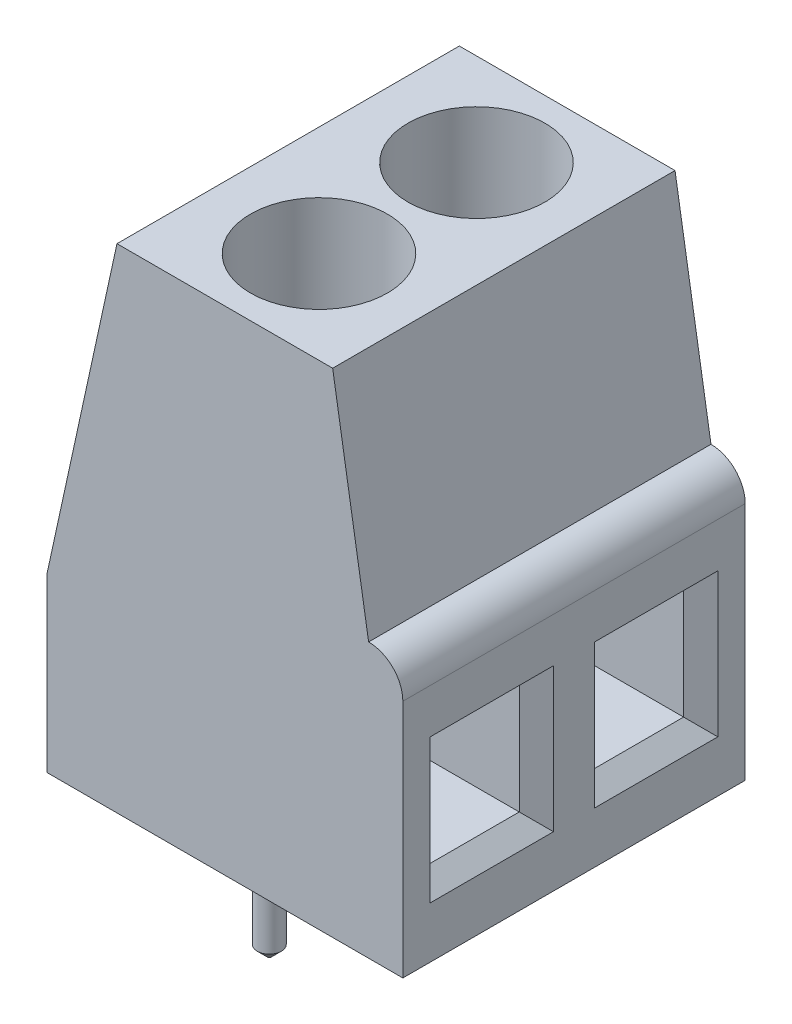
ISO-10303-21;
HEADER;
FILE_DESCRIPTION(('STEP AP214'),'2;1');
FILE_NAME('part.step','',(''),(''),'','','');
FILE_SCHEMA(('AUTOMOTIVE_DESIGN { 1 0 10303 214 1 1 1 1 }'));
ENDSEC;
DATA;
#1=APPLICATION_CONTEXT('core data for automotive mechanical design processes');
#2=APPLICATION_PROTOCOL_DEFINITION('international standard','automotive_design',2000,#1);
#3=PRODUCT_CONTEXT('',#1,'mechanical');
#4=PRODUCT('Part','Part','',(#3));
#5=PRODUCT_RELATED_PRODUCT_CATEGORY('part','',(#4));
#6=PRODUCT_DEFINITION_FORMATION('','',#4);
#7=PRODUCT_DEFINITION_CONTEXT('part definition',#1,'design');
#8=PRODUCT_DEFINITION('design','',#6,#7);
#9=PRODUCT_DEFINITION_SHAPE('','',#8);
#10=(LENGTH_UNIT() NAMED_UNIT(*) SI_UNIT(.MILLI.,.METRE.));
#11=(NAMED_UNIT(*) PLANE_ANGLE_UNIT() SI_UNIT($,.RADIAN.));
#12=(NAMED_UNIT(*) SI_UNIT($,.STERADIAN.) SOLID_ANGLE_UNIT());
#13=UNCERTAINTY_MEASURE_WITH_UNIT(LENGTH_MEASURE(1.E-05),#10,'distance_accuracy_value','');
#14=(GEOMETRIC_REPRESENTATION_CONTEXT(3) GLOBAL_UNCERTAINTY_ASSIGNED_CONTEXT((#13)) GLOBAL_UNIT_ASSIGNED_CONTEXT((#10,
#11,#12)) REPRESENTATION_CONTEXT('',''));
#15=CARTESIAN_POINT('',(0.,0.,0.));
#16=DIRECTION('',(0.,0.,1.));
#17=DIRECTION('',(1.,0.,0.));
#18=AXIS2_PLACEMENT_3D('',#15,#16,#17);
#19=CARTESIAN_POINT('',(0.,0.,-10.));
#20=DIRECTION('',(-1.,0.,0.));
#21=DIRECTION('',(0.,0.,1.));
#22=AXIS2_PLACEMENT_3D('',#19,#20,#21);
#23=PLANE('',#22);
#24=DIRECTION('',(0.,-1.,0.));
#25=VECTOR('',#24,1.);
#26=CARTESIAN_POINT('',(0.,0.,0.));
#27=LINE('',#26,#25);
#28=CARTESIAN_POINT('',(0.,5.,0.));
#29=VERTEX_POINT('',#28);
#30=CARTESIAN_POINT('',(0.,0.,0.));
#31=VERTEX_POINT('',#30);
#32=EDGE_CURVE('E218',#29,#31,#27,.T.);
#33=ORIENTED_EDGE('',*,*,#32,.F.);
#34=DIRECTION('',(0.,0.,1.));
#35=VECTOR('',#34,1.);
#36=CARTESIAN_POINT('',(0.,5.,-10.));
#37=LINE('',#36,#35);
#38=CARTESIAN_POINT('',(0.,5.,-10.));
#39=VERTEX_POINT('',#38);
#40=EDGE_CURVE('E268',#39,#29,#37,.T.);
#41=ORIENTED_EDGE('',*,*,#40,.F.);
#42=DIRECTION('',(0.,-1.,0.));
#43=VECTOR('',#42,1.);
#44=CARTESIAN_POINT('',(0.,0.,-10.));
#45=LINE('',#44,#43);
#46=CARTESIAN_POINT('',(0.,0.,-10.));
#47=VERTEX_POINT('',#46);
#48=EDGE_CURVE('E227',#39,#47,#45,.T.);
#49=ORIENTED_EDGE('',*,*,#48,.T.);
#50=DIRECTION('',(0.,0.,1.));
#51=VECTOR('',#50,1.);
#52=CARTESIAN_POINT('',(0.,0.,-10.));
#53=LINE('',#52,#51);
#54=EDGE_CURVE('E248',#47,#31,#53,.T.);
#55=ORIENTED_EDGE('',*,*,#54,.T.);
#56=EDGE_LOOP('',(#33,#41,#49,#55));
#57=FACE_BOUND('',#56,.T.);
#58=ADVANCED_FACE('F34',(#57),#23,.T.);
#59=CARTESIAN_POINT('',(2.05,14.4,-10.));
#60=DIRECTION('',(-0.977035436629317,0.213076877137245,0.));
#61=DIRECTION('',(-0.213076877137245,-0.977035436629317,0.));
#62=AXIS2_PLACEMENT_3D('',#59,#60,#61);
#63=PLANE('',#62);
#64=DIRECTION('',(-0.213076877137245,-0.977035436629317,0.));
#65=VECTOR('',#64,1.);
#66=CARTESIAN_POINT('',(2.05,14.4,0.));
#67=LINE('',#66,#65);
#68=CARTESIAN_POINT('',(2.05,14.4,0.));
#69=VERTEX_POINT('',#68);
#70=EDGE_CURVE('E231',#69,#29,#67,.T.);
#71=ORIENTED_EDGE('',*,*,#70,.F.);
#72=DIRECTION('',(0.,0.,1.));
#73=VECTOR('',#72,1.);
#74=CARTESIAN_POINT('',(2.05,14.4,-10.));
#75=LINE('',#74,#73);
#76=CARTESIAN_POINT('',(2.05,14.4,-10.));
#77=VERTEX_POINT('',#76);
#78=EDGE_CURVE('E271',#77,#69,#75,.T.);
#79=ORIENTED_EDGE('',*,*,#78,.F.);
#80=DIRECTION('',(-0.213076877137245,-0.977035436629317,0.));
#81=VECTOR('',#80,1.);
#82=CARTESIAN_POINT('',(2.05,14.4,-10.));
#83=LINE('',#82,#81);
#84=EDGE_CURVE('E245',#77,#39,#83,.T.);
#85=ORIENTED_EDGE('',*,*,#84,.T.);
#86=ORIENTED_EDGE('',*,*,#40,.T.);
#87=EDGE_LOOP('',(#71,#79,#85,#86));
#88=FACE_BOUND('',#87,.T.);
#89=ADVANCED_FACE('F353',(#88),#63,.T.);
#90=CARTESIAN_POINT('',(5.2,14.4,-10.));
#91=DIRECTION('',(0.,1.,0.));
#92=DIRECTION('',(0.,0.,1.));
#93=AXIS2_PLACEMENT_3D('',#90,#91,#92);
#94=PLANE('',#93);
#95=CARTESIAN_POINT('',(5.25,14.4,-7.3));
#96=DIRECTION('',(0.,1.,0.));
#97=DIRECTION('',(0.,0.,1.));
#98=AXIS2_PLACEMENT_3D('',#95,#96,#97);
#99=CIRCLE('',#98,2.);
#100=CARTESIAN_POINT('',(5.25,14.4,-5.3));
#101=VERTEX_POINT('',#100);
#102=EDGE_CURVE('E498',#101,#101,#99,.T.);
#103=ORIENTED_EDGE('',*,*,#102,.F.);
#104=EDGE_LOOP('',(#103));
#105=FACE_BOUND('',#104,.T.);
#106=CARTESIAN_POINT('',(5.25,14.4,-2.7));
#107=DIRECTION('',(0.,1.,0.));
#108=DIRECTION('',(0.,0.,1.));
#109=AXIS2_PLACEMENT_3D('',#106,#107,#108);
#110=CIRCLE('',#109,2.);
#111=CARTESIAN_POINT('',(5.25,14.4,-0.7));
#112=VERTEX_POINT('',#111);
#113=EDGE_CURVE('E192',#112,#112,#110,.T.);
#114=ORIENTED_EDGE('',*,*,#113,.F.);
#115=EDGE_LOOP('',(#114));
#116=FACE_BOUND('',#115,.T.);
#117=DIRECTION('',(-1.,0.,0.));
#118=VECTOR('',#117,1.);
#119=CARTESIAN_POINT('',(5.2,14.4,0.));
#120=LINE('',#119,#118);
#121=CARTESIAN_POINT('',(8.35,14.4,0.));
#122=VERTEX_POINT('',#121);
#123=EDGE_CURVE('E263',#122,#69,#120,.T.);
#124=ORIENTED_EDGE('',*,*,#123,.F.);
#125=DIRECTION('',(0.,0.,1.));
#126=VECTOR('',#125,1.);
#127=CARTESIAN_POINT('',(8.35,14.4,-10.));
#128=LINE('',#127,#126);
#129=CARTESIAN_POINT('',(8.35,14.4,-10.));
#130=VERTEX_POINT('',#129);
#131=EDGE_CURVE('E273',#130,#122,#128,.T.);
#132=ORIENTED_EDGE('',*,*,#131,.F.);
#133=DIRECTION('',(-1.,0.,0.));
#134=VECTOR('',#133,1.);
#135=CARTESIAN_POINT('',(5.2,14.4,-10.));
#136=LINE('',#135,#134);
#137=EDGE_CURVE('E243',#130,#77,#136,.T.);
#138=ORIENTED_EDGE('',*,*,#137,.T.);
#139=ORIENTED_EDGE('',*,*,#78,.T.);
#140=EDGE_LOOP('',(#124,#132,#138,#139));
#141=FACE_BOUND('',#140,.T.);
#142=ADVANCED_FACE('F359',(#105,#116,#141),#94,.T.);
#143=CARTESIAN_POINT('',(8.35,14.4,-10.));
#144=DIRECTION('',(0.986807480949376,0.161898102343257,0.));
#145=DIRECTION('',(-0.161898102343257,0.986807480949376,0.));
#146=AXIS2_PLACEMENT_3D('',#143,#144,#145);
#147=PLANE('',#146);
#148=DIRECTION('',(-0.161898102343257,0.986807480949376,0.));
#149=VECTOR('',#148,1.);
#150=CARTESIAN_POINT('',(8.35,14.4,0.));
#151=LINE('',#150,#149);
#152=CARTESIAN_POINT('',(9.4,8.,0.));
#153=VERTEX_POINT('',#152);
#154=EDGE_CURVE('E260',#153,#122,#151,.T.);
#155=ORIENTED_EDGE('',*,*,#154,.F.);
#156=DIRECTION('',(0.,0.,1.));
#157=VECTOR('',#156,1.);
#158=CARTESIAN_POINT('',(9.4,8.,-10.));
#159=LINE('',#158,#157);
#160=CARTESIAN_POINT('',(9.4,8.,-10.));
#161=VERTEX_POINT('',#160);
#162=EDGE_CURVE('E276',#161,#153,#159,.T.);
#163=ORIENTED_EDGE('',*,*,#162,.F.);
#164=DIRECTION('',(-0.161898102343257,0.986807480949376,0.));
#165=VECTOR('',#164,1.);
#166=CARTESIAN_POINT('',(8.35,14.4,-10.));
#167=LINE('',#166,#165);
#168=EDGE_CURVE('E240',#161,#130,#167,.T.);
#169=ORIENTED_EDGE('',*,*,#168,.T.);
#170=ORIENTED_EDGE('',*,*,#131,.T.);
#171=EDGE_LOOP('',(#155,#163,#169,#170));
#172=FACE_BOUND('',#171,.T.);
#173=ADVANCED_FACE('F459',(#172),#147,.T.);
#174=CARTESIAN_POINT('',(9.4,7.,-10.));
#175=DIRECTION('',(0.,0.,1.));
#176=DIRECTION('',(1.,0.,0.));
#177=AXIS2_PLACEMENT_3D('',#174,#175,#176);
#178=CYLINDRICAL_SURFACE('',#177,1.);
#179=CARTESIAN_POINT('',(9.4,7.,0.));
#180=DIRECTION('',(0.,0.,1.));
#181=DIRECTION('',(1.,0.,0.));
#182=AXIS2_PLACEMENT_3D('',#179,#180,#181);
#183=CIRCLE('',#182,1.);
#184=CARTESIAN_POINT('',(10.4,7.,0.));
#185=VERTEX_POINT('',#184);
#186=EDGE_CURVE('E257',#185,#153,#183,.T.);
#187=ORIENTED_EDGE('',*,*,#186,.F.);
#188=DIRECTION('',(0.,0.,1.));
#189=VECTOR('',#188,1.);
#190=CARTESIAN_POINT('',(10.4,7.,-10.));
#191=LINE('',#190,#189);
#192=CARTESIAN_POINT('',(10.4,7.,-10.));
#193=VERTEX_POINT('',#192);
#194=EDGE_CURVE('E278',#193,#185,#191,.T.);
#195=ORIENTED_EDGE('',*,*,#194,.F.);
#196=CARTESIAN_POINT('',(9.4,7.,-10.));
#197=DIRECTION('',(0.,0.,1.));
#198=DIRECTION('',(1.,0.,0.));
#199=AXIS2_PLACEMENT_3D('',#196,#197,#198);
#200=CIRCLE('',#199,1.);
#201=EDGE_CURVE('E237',#193,#161,#200,.T.);
#202=ORIENTED_EDGE('',*,*,#201,.T.);
#203=ORIENTED_EDGE('',*,*,#162,.T.);
#204=EDGE_LOOP('',(#187,#195,#202,#203));
#205=FACE_BOUND('',#204,.T.);
#206=ADVANCED_FACE('F463',(#205),#178,.T.);
#207=CARTESIAN_POINT('',(10.4,0.,-10.));
#208=DIRECTION('',(1.,0.,0.));
#209=DIRECTION('',(0.,0.,-1.));
#210=AXIS2_PLACEMENT_3D('',#207,#208,#209);
#211=PLANE('',#210);
#212=DIRECTION('',(0.,0.,1.));
#213=VECTOR('',#212,1.);
#214=CARTESIAN_POINT('',(10.4,1.5,-6.1));
#215=LINE('',#214,#213);
#216=CARTESIAN_POINT('',(10.4,1.5,-9.2));
#217=VERTEX_POINT('',#216);
#218=CARTESIAN_POINT('',(10.4,1.5,-5.6));
#219=VERTEX_POINT('',#218);
#220=EDGE_CURVE('E314',#217,#219,#215,.T.);
#221=ORIENTED_EDGE('',*,*,#220,.T.);
#222=DIRECTION('',(0.,1.,0.));
#223=VECTOR('',#222,1.);
#224=CARTESIAN_POINT('',(10.4,5.2,-5.6));
#225=LINE('',#224,#223);
#226=CARTESIAN_POINT('',(10.4,5.7,-5.6));
#227=VERTEX_POINT('',#226);
#228=EDGE_CURVE('E316',#219,#227,#225,.T.);
#229=ORIENTED_EDGE('',*,*,#228,.T.);
#230=DIRECTION('',(0.,0.,-1.));
#231=VECTOR('',#230,1.);
#232=CARTESIAN_POINT('',(10.4,5.7,-8.7));
#233=LINE('',#232,#231);
#234=CARTESIAN_POINT('',(10.4,5.7,-9.2));
#235=VERTEX_POINT('',#234);
#236=EDGE_CURVE('E310',#227,#235,#233,.T.);
#237=ORIENTED_EDGE('',*,*,#236,.T.);
#238=DIRECTION('',(0.,-1.,0.));
#239=VECTOR('',#238,1.);
#240=CARTESIAN_POINT('',(10.4,2.,-9.2));
#241=LINE('',#240,#239);
#242=EDGE_CURVE('E312',#235,#217,#241,.T.);
#243=ORIENTED_EDGE('',*,*,#242,.T.);
#244=EDGE_LOOP('',(#221,#229,#237,#243));
#245=FACE_BOUND('',#244,.T.);
#246=DIRECTION('',(0.,-1.,0.));
#247=VECTOR('',#246,1.);
#248=CARTESIAN_POINT('',(10.4,2.,-4.4));
#249=LINE('',#248,#247);
#250=CARTESIAN_POINT('',(10.4,5.7,-4.4));
#251=VERTEX_POINT('',#250);
#252=CARTESIAN_POINT('',(10.4,1.5,-4.4));
#253=VERTEX_POINT('',#252);
#254=EDGE_CURVE('E289',#251,#253,#249,.T.);
#255=ORIENTED_EDGE('',*,*,#254,.T.);
#256=DIRECTION('',(0.,0.,1.));
#257=VECTOR('',#256,1.);
#258=CARTESIAN_POINT('',(10.4,1.5,-1.3));
#259=LINE('',#258,#257);
#260=CARTESIAN_POINT('',(10.4,1.5,-0.799999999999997));
#261=VERTEX_POINT('',#260);
#262=EDGE_CURVE('E291',#253,#261,#259,.T.);
#263=ORIENTED_EDGE('',*,*,#262,.T.);
#264=DIRECTION('',(0.,1.,0.));
#265=VECTOR('',#264,1.);
#266=CARTESIAN_POINT('',(10.4,5.2,-0.799999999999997));
#267=LINE('',#266,#265);
#268=CARTESIAN_POINT('',(10.4,5.7,-0.799999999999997));
#269=VERTEX_POINT('',#268);
#270=EDGE_CURVE('E285',#261,#269,#267,.T.);
#271=ORIENTED_EDGE('',*,*,#270,.T.);
#272=DIRECTION('',(0.,0.,-1.));
#273=VECTOR('',#272,1.);
#274=CARTESIAN_POINT('',(10.4,5.7,-3.9));
#275=LINE('',#274,#273);
#276=EDGE_CURVE('E287',#269,#251,#275,.T.);
#277=ORIENTED_EDGE('',*,*,#276,.T.);
#278=EDGE_LOOP('',(#255,#263,#271,#277));
#279=FACE_BOUND('',#278,.T.);
#280=DIRECTION('',(0.,1.,0.));
#281=VECTOR('',#280,1.);
#282=CARTESIAN_POINT('',(10.4,0.,0.));
#283=LINE('',#282,#281);
#284=CARTESIAN_POINT('',(10.4,0.,0.));
#285=VERTEX_POINT('',#284);
#286=EDGE_CURVE('E254',#285,#185,#283,.T.);
#287=ORIENTED_EDGE('',*,*,#286,.F.);
#288=DIRECTION('',(0.,0.,1.));
#289=VECTOR('',#288,1.);
#290=CARTESIAN_POINT('',(10.4,0.,-10.));
#291=LINE('',#290,#289);
#292=CARTESIAN_POINT('',(10.4,0.,-10.));
#293=VERTEX_POINT('',#292);
#294=EDGE_CURVE('E280',#293,#285,#291,.T.);
#295=ORIENTED_EDGE('',*,*,#294,.F.);
#296=DIRECTION('',(0.,1.,0.));
#297=VECTOR('',#296,1.);
#298=CARTESIAN_POINT('',(10.4,0.,-10.));
#299=LINE('',#298,#297);
#300=EDGE_CURVE('E234',#293,#193,#299,.T.);
#301=ORIENTED_EDGE('',*,*,#300,.T.);
#302=ORIENTED_EDGE('',*,*,#194,.T.);
#303=EDGE_LOOP('',(#287,#295,#301,#302));
#304=FACE_BOUND('',#303,.T.);
#305=ADVANCED_FACE('F407',(#245,#279,#304),#211,.T.);
#306=CARTESIAN_POINT('',(0.,0.,-10.));
#307=DIRECTION('',(0.,-1.,0.));
#308=DIRECTION('',(0.,0.,-1.));
#309=AXIS2_PLACEMENT_3D('',#306,#307,#308);
#310=PLANE('',#309);
#311=CARTESIAN_POINT('',(4.3,0.,-7.8));
#312=DIRECTION('',(0.,-1.,0.));
#313=DIRECTION('',(0.,0.,-1.));
#314=AXIS2_PLACEMENT_3D('',#311,#312,#313);
#315=CIRCLE('',#314,0.35);
#316=CARTESIAN_POINT('',(4.3,0.,-8.15));
#317=VERTEX_POINT('',#316);
#318=EDGE_CURVE('E477',#317,#317,#315,.T.);
#319=ORIENTED_EDGE('',*,*,#318,.F.);
#320=EDGE_LOOP('',(#319));
#321=FACE_BOUND('',#320,.T.);
#322=CARTESIAN_POINT('',(4.3,0.,-2.2));
#323=DIRECTION('',(0.,-1.,0.));
#324=DIRECTION('',(0.,0.,-1.));
#325=AXIS2_PLACEMENT_3D('',#322,#323,#324);
#326=CIRCLE('',#325,0.35);
#327=CARTESIAN_POINT('',(4.3,0.,-2.55));
#328=VERTEX_POINT('',#327);
#329=EDGE_CURVE('E481',#328,#328,#326,.T.);
#330=ORIENTED_EDGE('',*,*,#329,.F.);
#331=EDGE_LOOP('',(#330));
#332=FACE_BOUND('',#331,.T.);
#333=DIRECTION('',(1.,0.,0.));
#334=VECTOR('',#333,1.);
#335=CARTESIAN_POINT('',(0.,0.,0.));
#336=LINE('',#335,#334);
#337=EDGE_CURVE('E251',#31,#285,#336,.T.);
#338=ORIENTED_EDGE('',*,*,#337,.F.);
#339=ORIENTED_EDGE('',*,*,#54,.F.);
#340=DIRECTION('',(1.,0.,0.));
#341=VECTOR('',#340,1.);
#342=CARTESIAN_POINT('',(0.,0.,-10.));
#343=LINE('',#342,#341);
#344=EDGE_CURVE('E230',#47,#293,#343,.T.);
#345=ORIENTED_EDGE('',*,*,#344,.T.);
#346=ORIENTED_EDGE('',*,*,#294,.T.);
#347=EDGE_LOOP('',(#338,#339,#345,#346));
#348=FACE_BOUND('',#347,.T.);
#349=ADVANCED_FACE('F365',(#321,#332,#348),#310,.T.);
#350=CARTESIAN_POINT('',(9.4,7.,-10.));
#351=DIRECTION('',(0.,0.,1.));
#352=DIRECTION('',(1.,0.,0.));
#353=AXIS2_PLACEMENT_3D('',#350,#351,#352);
#354=PLANE('',#353);
#355=ORIENTED_EDGE('',*,*,#48,.F.);
#356=ORIENTED_EDGE('',*,*,#84,.F.);
#357=ORIENTED_EDGE('',*,*,#137,.F.);
#358=ORIENTED_EDGE('',*,*,#168,.F.);
#359=ORIENTED_EDGE('',*,*,#201,.F.);
#360=ORIENTED_EDGE('',*,*,#300,.F.);
#361=ORIENTED_EDGE('',*,*,#344,.F.);
#362=EDGE_LOOP('',(#355,#356,#357,#358,#359,#360,#361));
#363=FACE_BOUND('',#362,.T.);
#364=ADVANCED_FACE('F450',(#363),#354,.F.);
#365=CARTESIAN_POINT('',(9.4,7.,0.));
#366=DIRECTION('',(0.,0.,1.));
#367=DIRECTION('',(1.,0.,0.));
#368=AXIS2_PLACEMENT_3D('',#365,#366,#367);
#369=PLANE('',#368);
#370=ORIENTED_EDGE('',*,*,#32,.T.);
#371=ORIENTED_EDGE('',*,*,#337,.T.);
#372=ORIENTED_EDGE('',*,*,#286,.T.);
#373=ORIENTED_EDGE('',*,*,#186,.T.);
#374=ORIENTED_EDGE('',*,*,#154,.T.);
#375=ORIENTED_EDGE('',*,*,#123,.T.);
#376=ORIENTED_EDGE('',*,*,#70,.T.);
#377=EDGE_LOOP('',(#370,#371,#372,#373,#374,#375,#376));
#378=FACE_BOUND('',#377,.T.);
#379=ADVANCED_FACE('F448',(#378),#369,.T.);
#380=CARTESIAN_POINT('',(5.4,2.,-1.3));
#381=DIRECTION('',(0.,0.,1.));
#382=DIRECTION('',(1.,0.,0.));
#383=AXIS2_PLACEMENT_3D('',#380,#381,#382);
#384=PLANE('',#383);
#385=DIRECTION('',(1.,0.,0.));
#386=VECTOR('',#385,1.);
#387=CARTESIAN_POINT('',(5.4,5.2,-1.3));
#388=LINE('',#387,#386);
#389=CARTESIAN_POINT('',(5.4,5.2,-1.3));
#390=VERTEX_POINT('',#389);
#391=CARTESIAN_POINT('',(9.9,5.2,-1.3));
#392=VERTEX_POINT('',#391);
#393=EDGE_CURVE('E215',#390,#392,#388,.T.);
#394=ORIENTED_EDGE('',*,*,#393,.T.);
#395=DIRECTION('',(0.,-1.,0.));
#396=VECTOR('',#395,1.);
#397=CARTESIAN_POINT('',(9.9,2.,-1.3));
#398=LINE('',#397,#396);
#399=CARTESIAN_POINT('',(9.9,2.,-1.3));
#400=VERTEX_POINT('',#399);
#401=EDGE_CURVE('E298',#392,#400,#398,.T.);
#402=ORIENTED_EDGE('',*,*,#401,.T.);
#403=DIRECTION('',(1.,0.,0.));
#404=VECTOR('',#403,1.);
#405=CARTESIAN_POINT('',(5.4,2.,-1.3));
#406=LINE('',#405,#404);
#407=CARTESIAN_POINT('',(5.4,2.,-1.3));
#408=VERTEX_POINT('',#407);
#409=EDGE_CURVE('E214',#408,#400,#406,.T.);
#410=ORIENTED_EDGE('',*,*,#409,.F.);
#411=DIRECTION('',(0.,-1.,0.));
#412=VECTOR('',#411,1.);
#413=CARTESIAN_POINT('',(5.4,2.,-1.3));
#414=LINE('',#413,#412);
#415=EDGE_CURVE('E199',#390,#408,#414,.T.);
#416=ORIENTED_EDGE('',*,*,#415,.F.);
#417=EDGE_LOOP('',(#394,#402,#410,#416));
#418=FACE_BOUND('',#417,.T.);
#419=ADVANCED_FACE('F438',(#418),#384,.F.);
#420=CARTESIAN_POINT('',(5.4,5.2,-1.3));
#421=DIRECTION('',(0.,1.,0.));
#422=DIRECTION('',(0.,0.,1.));
#423=AXIS2_PLACEMENT_3D('',#420,#421,#422);
#424=PLANE('',#423);
#425=DIRECTION('',(1.,0.,0.));
#426=VECTOR('',#425,1.);
#427=CARTESIAN_POINT('',(5.4,5.2,-3.9));
#428=LINE('',#427,#426);
#429=CARTESIAN_POINT('',(5.4,5.2,-3.9));
#430=VERTEX_POINT('',#429);
#431=CARTESIAN_POINT('',(9.9,5.2,-3.9));
#432=VERTEX_POINT('',#431);
#433=EDGE_CURVE('E219',#430,#432,#428,.T.);
#434=ORIENTED_EDGE('',*,*,#433,.T.);
#435=DIRECTION('',(0.,0.,1.));
#436=VECTOR('',#435,1.);
#437=CARTESIAN_POINT('',(9.9,5.2,-1.3));
#438=LINE('',#437,#436);
#439=EDGE_CURVE('E296',#432,#392,#438,.T.);
#440=ORIENTED_EDGE('',*,*,#439,.T.);
#441=ORIENTED_EDGE('',*,*,#393,.F.);
#442=DIRECTION('',(0.,0.,1.));
#443=VECTOR('',#442,1.);
#444=CARTESIAN_POINT('',(5.4,5.2,-1.3));
#445=LINE('',#444,#443);
#446=EDGE_CURVE('E211',#430,#390,#445,.T.);
#447=ORIENTED_EDGE('',*,*,#446,.F.);
#448=EDGE_LOOP('',(#434,#440,#441,#447));
#449=FACE_BOUND('',#448,.T.);
#450=ADVANCED_FACE('F434',(#449),#424,.F.);
#451=CARTESIAN_POINT('',(5.4,2.,-3.9));
#452=DIRECTION('',(0.,0.,-1.));
#453=DIRECTION('',(-1.,0.,0.));
#454=AXIS2_PLACEMENT_3D('',#451,#452,#453);
#455=PLANE('',#454);
#456=DIRECTION('',(1.,0.,0.));
#457=VECTOR('',#456,1.);
#458=CARTESIAN_POINT('',(5.4,2.,-3.9));
#459=LINE('',#458,#457);
#460=CARTESIAN_POINT('',(5.4,2.,-3.9));
#461=VERTEX_POINT('',#460);
#462=CARTESIAN_POINT('',(9.9,2.,-3.9));
#463=VERTEX_POINT('',#462);
#464=EDGE_CURVE('E222',#461,#463,#459,.T.);
#465=ORIENTED_EDGE('',*,*,#464,.T.);
#466=DIRECTION('',(0.,1.,0.));
#467=VECTOR('',#466,1.);
#468=CARTESIAN_POINT('',(9.9,5.2,-3.9));
#469=LINE('',#468,#467);
#470=EDGE_CURVE('E294',#463,#432,#469,.T.);
#471=ORIENTED_EDGE('',*,*,#470,.T.);
#472=ORIENTED_EDGE('',*,*,#433,.F.);
#473=DIRECTION('',(0.,1.,0.));
#474=VECTOR('',#473,1.);
#475=CARTESIAN_POINT('',(5.4,2.,-3.9));
#476=LINE('',#475,#474);
#477=EDGE_CURVE('E208',#461,#430,#476,.T.);
#478=ORIENTED_EDGE('',*,*,#477,.F.);
#479=EDGE_LOOP('',(#465,#471,#472,#478));
#480=FACE_BOUND('',#479,.T.);
#481=ADVANCED_FACE('F437',(#480),#455,.F.);
#482=CARTESIAN_POINT('',(5.4,2.,-1.3));
#483=DIRECTION('',(0.,-1.,0.));
#484=DIRECTION('',(0.,0.,-1.));
#485=AXIS2_PLACEMENT_3D('',#482,#483,#484);
#486=PLANE('',#485);
#487=ORIENTED_EDGE('',*,*,#409,.T.);
#488=DIRECTION('',(0.,0.,-1.));
#489=VECTOR('',#488,1.);
#490=CARTESIAN_POINT('',(9.9,2.,-3.9));
#491=LINE('',#490,#489);
#492=EDGE_CURVE('E270',#400,#463,#491,.T.);
#493=ORIENTED_EDGE('',*,*,#492,.T.);
#494=ORIENTED_EDGE('',*,*,#464,.F.);
#495=DIRECTION('',(0.,0.,-1.));
#496=VECTOR('',#495,1.);
#497=CARTESIAN_POINT('',(5.4,2.,-1.3));
#498=LINE('',#497,#496);
#499=EDGE_CURVE('E205',#408,#461,#498,.T.);
#500=ORIENTED_EDGE('',*,*,#499,.F.);
#501=EDGE_LOOP('',(#487,#493,#494,#500));
#502=FACE_BOUND('',#501,.T.);
#503=ADVANCED_FACE('F432',(#502),#486,.F.);
#504=CARTESIAN_POINT('',(5.4,0.,0.));
#505=DIRECTION('',(-1.,0.,0.));
#506=DIRECTION('',(0.,0.,1.));
#507=AXIS2_PLACEMENT_3D('',#504,#505,#506);
#508=PLANE('',#507);
#509=ORIENTED_EDGE('',*,*,#415,.T.);
#510=ORIENTED_EDGE('',*,*,#499,.T.);
#511=ORIENTED_EDGE('',*,*,#477,.T.);
#512=ORIENTED_EDGE('',*,*,#446,.T.);
#513=EDGE_LOOP('',(#509,#510,#511,#512));
#514=FACE_BOUND('',#513,.T.);
#515=ADVANCED_FACE('F423',(#514),#508,.F.);
#516=CARTESIAN_POINT('',(5.4,2.,-8.7));
#517=DIRECTION('',(0.,0.,-1.));
#518=DIRECTION('',(-1.,0.,0.));
#519=AXIS2_PLACEMENT_3D('',#516,#517,#518);
#520=PLANE('',#519);
#521=DIRECTION('',(1.,0.,0.));
#522=VECTOR('',#521,1.);
#523=CARTESIAN_POINT('',(5.4,2.,-8.7));
#524=LINE('',#523,#522);
#525=CARTESIAN_POINT('',(5.4,2.,-8.7));
#526=VERTEX_POINT('',#525);
#527=CARTESIAN_POINT('',(9.9,2.,-8.7));
#528=VERTEX_POINT('',#527);
#529=EDGE_CURVE('E197',#526,#528,#524,.T.);
#530=ORIENTED_EDGE('',*,*,#529,.T.);
#531=DIRECTION('',(0.,1.,0.));
#532=VECTOR('',#531,1.);
#533=CARTESIAN_POINT('',(9.9,5.2,-8.7));
#534=LINE('',#533,#532);
#535=CARTESIAN_POINT('',(9.9,5.2,-8.7));
#536=VERTEX_POINT('',#535);
#537=EDGE_CURVE('E49',#528,#536,#534,.T.);
#538=ORIENTED_EDGE('',*,*,#537,.T.);
#539=DIRECTION('',(1.,0.,0.));
#540=VECTOR('',#539,1.);
#541=CARTESIAN_POINT('',(5.4,5.2,-8.7));
#542=LINE('',#541,#540);
#543=CARTESIAN_POINT('',(5.4,5.2,-8.7));
#544=VERTEX_POINT('',#543);
#545=EDGE_CURVE('E164',#544,#536,#542,.T.);
#546=ORIENTED_EDGE('',*,*,#545,.F.);
#547=DIRECTION('',(0.,1.,0.));
#548=VECTOR('',#547,1.);
#549=CARTESIAN_POINT('',(5.4,2.,-8.7));
#550=LINE('',#549,#548);
#551=EDGE_CURVE('E168',#526,#544,#550,.T.);
#552=ORIENTED_EDGE('',*,*,#551,.F.);
#553=EDGE_LOOP('',(#530,#538,#546,#552));
#554=FACE_BOUND('',#553,.T.);
#555=ADVANCED_FACE('F166',(#554),#520,.F.);
#556=CARTESIAN_POINT('',(5.4,2.,-8.7));
#557=DIRECTION('',(0.,-1.,0.));
#558=DIRECTION('',(0.,0.,-1.));
#559=AXIS2_PLACEMENT_3D('',#556,#557,#558);
#560=PLANE('',#559);
#561=DIRECTION('',(1.,0.,0.));
#562=VECTOR('',#561,1.);
#563=CARTESIAN_POINT('',(5.4,2.,-6.1));
#564=LINE('',#563,#562);
#565=CARTESIAN_POINT('',(5.4,2.,-6.1));
#566=VERTEX_POINT('',#565);
#567=CARTESIAN_POINT('',(9.9,2.,-6.1));
#568=VERTEX_POINT('',#567);
#569=EDGE_CURVE('E200',#566,#568,#564,.T.);
#570=ORIENTED_EDGE('',*,*,#569,.T.);
#571=DIRECTION('',(0.,0.,-1.));
#572=VECTOR('',#571,1.);
#573=CARTESIAN_POINT('',(9.9,2.,-8.7));
#574=LINE('',#573,#572);
#575=EDGE_CURVE('E57',#568,#528,#574,.T.);
#576=ORIENTED_EDGE('',*,*,#575,.T.);
#577=ORIENTED_EDGE('',*,*,#529,.F.);
#578=DIRECTION('',(0.,0.,-1.));
#579=VECTOR('',#578,1.);
#580=CARTESIAN_POINT('',(5.4,2.,-8.7));
#581=LINE('',#580,#579);
#582=EDGE_CURVE('E173',#566,#526,#581,.T.);
#583=ORIENTED_EDGE('',*,*,#582,.F.);
#584=EDGE_LOOP('',(#570,#576,#577,#583));
#585=FACE_BOUND('',#584,.T.);
#586=ADVANCED_FACE('F415',(#585),#560,.F.);
#587=CARTESIAN_POINT('',(5.4,2.,-6.1));
#588=DIRECTION('',(0.,0.,1.));
#589=DIRECTION('',(1.,0.,0.));
#590=AXIS2_PLACEMENT_3D('',#587,#588,#589);
#591=PLANE('',#590);
#592=DIRECTION('',(1.,0.,0.));
#593=VECTOR('',#592,1.);
#594=CARTESIAN_POINT('',(5.4,5.2,-6.1));
#595=LINE('',#594,#593);
#596=CARTESIAN_POINT('',(5.4,5.2,-6.1));
#597=VERTEX_POINT('',#596);
#598=CARTESIAN_POINT('',(9.9,5.2,-6.1));
#599=VERTEX_POINT('',#598);
#600=EDGE_CURVE('E172',#597,#599,#595,.T.);
#601=ORIENTED_EDGE('',*,*,#600,.T.);
#602=DIRECTION('',(0.,-1.,0.));
#603=VECTOR('',#602,1.);
#604=CARTESIAN_POINT('',(9.9,2.,-6.1));
#605=LINE('',#604,#603);
#606=EDGE_CURVE('E300',#599,#568,#605,.T.);
#607=ORIENTED_EDGE('',*,*,#606,.T.);
#608=ORIENTED_EDGE('',*,*,#569,.F.);
#609=DIRECTION('',(0.,-1.,0.));
#610=VECTOR('',#609,1.);
#611=CARTESIAN_POINT('',(5.4,2.,-6.1));
#612=LINE('',#611,#610);
#613=EDGE_CURVE('E182',#597,#566,#612,.T.);
#614=ORIENTED_EDGE('',*,*,#613,.F.);
#615=EDGE_LOOP('',(#601,#607,#608,#614));
#616=FACE_BOUND('',#615,.T.);
#617=ADVANCED_FACE('F414',(#616),#591,.F.);
#618=CARTESIAN_POINT('',(5.4,5.2,-8.7));
#619=DIRECTION('',(0.,1.,0.));
#620=DIRECTION('',(0.,0.,1.));
#621=AXIS2_PLACEMENT_3D('',#618,#619,#620);
#622=PLANE('',#621);
#623=ORIENTED_EDGE('',*,*,#545,.T.);
#624=DIRECTION('',(0.,0.,1.));
#625=VECTOR('',#624,1.);
#626=CARTESIAN_POINT('',(9.9,5.2,-6.1));
#627=LINE('',#626,#625);
#628=EDGE_CURVE('E321',#536,#599,#627,.T.);
#629=ORIENTED_EDGE('',*,*,#628,.T.);
#630=ORIENTED_EDGE('',*,*,#600,.F.);
#631=DIRECTION('',(0.,0.,1.));
#632=VECTOR('',#631,1.);
#633=CARTESIAN_POINT('',(5.4,5.2,-8.7));
#634=LINE('',#633,#632);
#635=EDGE_CURVE('E176',#544,#597,#634,.T.);
#636=ORIENTED_EDGE('',*,*,#635,.F.);
#637=EDGE_LOOP('',(#623,#629,#630,#636));
#638=FACE_BOUND('',#637,.T.);
#639=ADVANCED_FACE('F177',(#638),#622,.F.);
#640=CARTESIAN_POINT('',(5.4,0.,0.));
#641=DIRECTION('',(1.,0.,0.));
#642=DIRECTION('',(0.,0.,-1.));
#643=AXIS2_PLACEMENT_3D('',#640,#641,#642);
#644=PLANE('',#643);
#645=ORIENTED_EDGE('',*,*,#551,.T.);
#646=ORIENTED_EDGE('',*,*,#635,.T.);
#647=ORIENTED_EDGE('',*,*,#613,.T.);
#648=ORIENTED_EDGE('',*,*,#582,.T.);
#649=EDGE_LOOP('',(#645,#646,#647,#648));
#650=FACE_BOUND('',#649,.T.);
#651=ADVANCED_FACE('F184',(#650),#644,.T.);
#652=CARTESIAN_POINT('',(9.9,5.2,-1.3));
#653=DIRECTION('',(0.707106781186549,-0.707106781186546,0.));
#654=DIRECTION('',(0.,0.,-1.));
#655=AXIS2_PLACEMENT_3D('',#652,#653,#654);
#656=PLANE('',#655);
#657=DIRECTION('',(0.577350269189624,0.577350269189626,-0.577350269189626));
#658=VECTOR('',#657,1.);
#659=CARTESIAN_POINT('',(8.83333333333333,4.13333333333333,-2.83333333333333));
#660=LINE('',#659,#658);
#661=EDGE_CURVE('E189',#251,#432,#660,.F.);
#662=ORIENTED_EDGE('',*,*,#661,.F.);
#663=ORIENTED_EDGE('',*,*,#276,.F.);
#664=DIRECTION('',(0.577350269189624,0.577350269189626,0.577350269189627));
#665=VECTOR('',#664,1.);
#666=CARTESIAN_POINT('',(9.9,5.2,-1.3));
#667=LINE('',#666,#665);
#668=EDGE_CURVE('E186',#392,#269,#667,.T.);
#669=ORIENTED_EDGE('',*,*,#668,.F.);
#670=ORIENTED_EDGE('',*,*,#439,.F.);
#671=EDGE_LOOP('',(#662,#663,#669,#670));
#672=FACE_BOUND('',#671,.T.);
#673=ADVANCED_FACE('F379',(#672),#656,.T.);
#674=CARTESIAN_POINT('',(9.9,2.,-1.3));
#675=DIRECTION('',(0.707106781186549,0.,-0.707106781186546));
#676=DIRECTION('',(0.,1.,0.));
#677=AXIS2_PLACEMENT_3D('',#674,#675,#676);
#678=PLANE('',#677);
#679=ORIENTED_EDGE('',*,*,#668,.T.);
#680=ORIENTED_EDGE('',*,*,#270,.F.);
#681=DIRECTION('',(-0.577350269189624,0.577350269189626,-0.577350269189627));
#682=VECTOR('',#681,1.);
#683=CARTESIAN_POINT('',(9.9,2.,-1.3));
#684=LINE('',#683,#682);
#685=EDGE_CURVE('E303',#400,#261,#684,.F.);
#686=ORIENTED_EDGE('',*,*,#685,.F.);
#687=ORIENTED_EDGE('',*,*,#401,.F.);
#688=EDGE_LOOP('',(#679,#680,#686,#687));
#689=FACE_BOUND('',#688,.T.);
#690=ADVANCED_FACE('F375',(#689),#678,.T.);
#691=CARTESIAN_POINT('',(9.9,2.,-3.9));
#692=DIRECTION('',(0.707106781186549,0.,0.707106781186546));
#693=DIRECTION('',(0.,-1.,0.));
#694=AXIS2_PLACEMENT_3D('',#691,#692,#693);
#695=PLANE('',#694);
#696=ORIENTED_EDGE('',*,*,#661,.T.);
#697=ORIENTED_EDGE('',*,*,#470,.F.);
#698=DIRECTION('',(0.577350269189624,-0.577350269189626,-0.577350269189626));
#699=VECTOR('',#698,1.);
#700=CARTESIAN_POINT('',(9.03333333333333,2.86666666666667,-3.03333333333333));
#701=LINE('',#700,#699);
#702=EDGE_CURVE('E301',#253,#463,#701,.F.);
#703=ORIENTED_EDGE('',*,*,#702,.F.);
#704=ORIENTED_EDGE('',*,*,#254,.F.);
#705=EDGE_LOOP('',(#696,#697,#703,#704));
#706=FACE_BOUND('',#705,.T.);
#707=ADVANCED_FACE('F371',(#706),#695,.T.);
#708=CARTESIAN_POINT('',(9.9,2.,-1.3));
#709=DIRECTION('',(0.707106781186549,0.707106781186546,0.));
#710=DIRECTION('',(0.,0.,1.));
#711=AXIS2_PLACEMENT_3D('',#708,#709,#710);
#712=PLANE('',#711);
#713=ORIENTED_EDGE('',*,*,#685,.T.);
#714=ORIENTED_EDGE('',*,*,#262,.F.);
#715=ORIENTED_EDGE('',*,*,#702,.T.);
#716=ORIENTED_EDGE('',*,*,#492,.F.);
#717=EDGE_LOOP('',(#713,#714,#715,#716));
#718=FACE_BOUND('',#717,.T.);
#719=ADVANCED_FACE('F367',(#718),#712,.T.);
#720=CARTESIAN_POINT('',(9.9,2.,-8.7));
#721=DIRECTION('',(0.707106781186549,0.,0.707106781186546));
#722=DIRECTION('',(0.,-1.,0.));
#723=AXIS2_PLACEMENT_3D('',#720,#721,#722);
#724=PLANE('',#723);
#725=DIRECTION('',(0.577350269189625,-0.577350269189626,-0.577350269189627));
#726=VECTOR('',#725,1.);
#727=CARTESIAN_POINT('',(9.9,2.,-8.7));
#728=LINE('',#727,#726);
#729=EDGE_CURVE('E329',#217,#528,#728,.F.);
#730=ORIENTED_EDGE('',*,*,#729,.F.);
#731=ORIENTED_EDGE('',*,*,#242,.F.);
#732=DIRECTION('',(0.577350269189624,0.577350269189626,-0.577350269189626));
#733=VECTOR('',#732,1.);
#734=CARTESIAN_POINT('',(8.83333333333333,4.13333333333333,-7.63333333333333));
#735=LINE('',#734,#733);
#736=EDGE_CURVE('E304',#536,#235,#735,.T.);
#737=ORIENTED_EDGE('',*,*,#736,.F.);
#738=ORIENTED_EDGE('',*,*,#537,.F.);
#739=EDGE_LOOP('',(#730,#731,#737,#738));
#740=FACE_BOUND('',#739,.T.);
#741=ADVANCED_FACE('F370',(#740),#724,.T.);
#742=CARTESIAN_POINT('',(9.9,5.2,-8.7));
#743=DIRECTION('',(0.707106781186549,-0.707106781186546,0.));
#744=DIRECTION('',(0.,0.,-1.));
#745=AXIS2_PLACEMENT_3D('',#742,#743,#744);
#746=PLANE('',#745);
#747=ORIENTED_EDGE('',*,*,#736,.T.);
#748=ORIENTED_EDGE('',*,*,#236,.F.);
#749=DIRECTION('',(-0.577350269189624,-0.577350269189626,-0.577350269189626));
#750=VECTOR('',#749,1.);
#751=CARTESIAN_POINT('',(8.83333333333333,4.13333333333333,-7.16666666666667));
#752=LINE('',#751,#750);
#753=EDGE_CURVE('E326',#599,#227,#752,.F.);
#754=ORIENTED_EDGE('',*,*,#753,.F.);
#755=ORIENTED_EDGE('',*,*,#628,.F.);
#756=EDGE_LOOP('',(#747,#748,#754,#755));
#757=FACE_BOUND('',#756,.T.);
#758=ADVANCED_FACE('F392',(#757),#746,.T.);
#759=CARTESIAN_POINT('',(9.9,2.,-8.7));
#760=DIRECTION('',(0.707106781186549,0.707106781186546,0.));
#761=DIRECTION('',(0.,0.,1.));
#762=AXIS2_PLACEMENT_3D('',#759,#760,#761);
#763=PLANE('',#762);
#764=ORIENTED_EDGE('',*,*,#729,.T.);
#765=ORIENTED_EDGE('',*,*,#575,.F.);
#766=DIRECTION('',(0.577350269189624,-0.577350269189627,0.577350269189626));
#767=VECTOR('',#766,1.);
#768=CARTESIAN_POINT('',(9.9,2.,-6.1));
#769=LINE('',#768,#767);
#770=EDGE_CURVE('E324',#219,#568,#769,.F.);
#771=ORIENTED_EDGE('',*,*,#770,.F.);
#772=ORIENTED_EDGE('',*,*,#220,.F.);
#773=EDGE_LOOP('',(#764,#765,#771,#772));
#774=FACE_BOUND('',#773,.T.);
#775=ADVANCED_FACE('F388',(#774),#763,.T.);
#776=CARTESIAN_POINT('',(9.9,2.,-6.1));
#777=DIRECTION('',(0.707106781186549,0.,-0.707106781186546));
#778=DIRECTION('',(0.,1.,0.));
#779=AXIS2_PLACEMENT_3D('',#776,#777,#778);
#780=PLANE('',#779);
#781=ORIENTED_EDGE('',*,*,#753,.T.);
#782=ORIENTED_EDGE('',*,*,#228,.F.);
#783=ORIENTED_EDGE('',*,*,#770,.T.);
#784=ORIENTED_EDGE('',*,*,#606,.F.);
#785=EDGE_LOOP('',(#781,#782,#783,#784));
#786=FACE_BOUND('',#785,.T.);
#787=ADVANCED_FACE('F384',(#786),#780,.T.);
#788=CARTESIAN_POINT('',(5.25,11.4,-2.7));
#789=DIRECTION('',(0.,1.,0.));
#790=DIRECTION('',(0.,0.,1.));
#791=AXIS2_PLACEMENT_3D('',#788,#789,#790);
#792=CYLINDRICAL_SURFACE('',#791,2.);
#793=CARTESIAN_POINT('',(5.25,11.4,-2.7));
#794=DIRECTION('',(0.,1.,0.));
#795=DIRECTION('',(0.,0.,1.));
#796=AXIS2_PLACEMENT_3D('',#793,#794,#795);
#797=CIRCLE('',#796,2.);
#798=CARTESIAN_POINT('',(5.25,11.4,-0.7));
#799=VERTEX_POINT('',#798);
#800=EDGE_CURVE('E327',#799,#799,#797,.T.);
#801=ORIENTED_EDGE('',*,*,#800,.F.);
#802=EDGE_LOOP('',(#801));
#803=FACE_BOUND('',#802,.T.);
#804=ORIENTED_EDGE('',*,*,#113,.T.);
#805=EDGE_LOOP('',(#804));
#806=FACE_BOUND('',#805,.T.);
#807=ADVANCED_FACE('F387',(#803,#806),#792,.F.);
#808=CARTESIAN_POINT('',(5.25,11.4,-2.7));
#809=DIRECTION('',(0.,1.,0.));
#810=DIRECTION('',(0.,0.,1.));
#811=AXIS2_PLACEMENT_3D('',#808,#809,#810);
#812=PLANE('',#811);
#813=ORIENTED_EDGE('',*,*,#800,.T.);
#814=EDGE_LOOP('',(#813));
#815=FACE_BOUND('',#814,.T.);
#816=ADVANCED_FACE('F514',(#815),#812,.T.);
#817=CARTESIAN_POINT('',(5.25,11.4,-7.3));
#818=DIRECTION('',(0.,1.,0.));
#819=DIRECTION('',(0.,0.,1.));
#820=AXIS2_PLACEMENT_3D('',#817,#818,#819);
#821=CYLINDRICAL_SURFACE('',#820,2.);
#822=CARTESIAN_POINT('',(5.25,11.4,-7.3));
#823=DIRECTION('',(0.,1.,0.));
#824=DIRECTION('',(0.,0.,1.));
#825=AXIS2_PLACEMENT_3D('',#822,#823,#824);
#826=CIRCLE('',#825,2.);
#827=CARTESIAN_POINT('',(5.25,11.4,-5.3));
#828=VERTEX_POINT('',#827);
#829=EDGE_CURVE('E501',#828,#828,#826,.T.);
#830=ORIENTED_EDGE('',*,*,#829,.F.);
#831=EDGE_LOOP('',(#830));
#832=FACE_BOUND('',#831,.T.);
#833=ORIENTED_EDGE('',*,*,#102,.T.);
#834=EDGE_LOOP('',(#833));
#835=FACE_BOUND('',#834,.T.);
#836=ADVANCED_FACE('F519',(#832,#835),#821,.F.);
#837=CARTESIAN_POINT('',(5.25,11.4,-7.3));
#838=DIRECTION('',(0.,1.,0.));
#839=DIRECTION('',(0.,0.,1.));
#840=AXIS2_PLACEMENT_3D('',#837,#838,#839);
#841=PLANE('',#840);
#842=ORIENTED_EDGE('',*,*,#829,.T.);
#843=EDGE_LOOP('',(#842));
#844=FACE_BOUND('',#843,.T.);
#845=ADVANCED_FACE('F524',(#844),#841,.T.);
#846=CARTESIAN_POINT('',(4.3,-3.6,-2.2));
#847=DIRECTION('',(0.,1.,0.));
#848=DIRECTION('',(0.,0.,1.));
#849=AXIS2_PLACEMENT_3D('',#846,#847,#848);
#850=CYLINDRICAL_SURFACE('',#849,0.35);
#851=CARTESIAN_POINT('',(4.3,-3.3,-2.2));
#852=DIRECTION('',(0.,-1.,0.));
#853=DIRECTION('',(0.,0.,-1.));
#854=AXIS2_PLACEMENT_3D('',#851,#852,#853);
#855=CIRCLE('',#854,0.35);
#856=CARTESIAN_POINT('',(4.3,-3.3,-1.85));
#857=VERTEX_POINT('',#856);
#858=EDGE_CURVE('E11',#857,#857,#855,.F.);
#859=ORIENTED_EDGE('',*,*,#858,.T.);
#860=EDGE_LOOP('',(#859));
#861=FACE_BOUND('',#860,.T.);
#862=ORIENTED_EDGE('',*,*,#329,.T.);
#863=EDGE_LOOP('',(#862));
#864=FACE_BOUND('',#863,.T.);
#865=ADVANCED_FACE('F528',(#861,#864),#850,.T.);
#866=CARTESIAN_POINT('',(4.3,-3.6,-2.2));
#867=DIRECTION('',(0.,-1.,0.));
#868=DIRECTION('',(0.,0.,-1.));
#869=AXIS2_PLACEMENT_3D('',#866,#867,#868);
#870=PLANE('',#869);
#871=CARTESIAN_POINT('',(4.3,-3.6,-2.2));
#872=DIRECTION('',(0.,-1.,0.));
#873=DIRECTION('',(0.,0.,-1.));
#874=AXIS2_PLACEMENT_3D('',#871,#872,#873);
#875=CIRCLE('',#874,0.0500000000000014);
#876=CARTESIAN_POINT('',(4.3,-3.6,-2.15));
#877=VERTEX_POINT('',#876);
#878=EDGE_CURVE('E42',#877,#877,#875,.T.);
#879=ORIENTED_EDGE('',*,*,#878,.T.);
#880=EDGE_LOOP('',(#879));
#881=FACE_BOUND('',#880,.T.);
#882=ADVANCED_FACE('F341',(#881),#870,.T.);
#883=CARTESIAN_POINT('',(4.3,-3.6,-7.8));
#884=DIRECTION('',(0.,1.,0.));
#885=DIRECTION('',(0.,0.,1.));
#886=AXIS2_PLACEMENT_3D('',#883,#884,#885);
#887=CYLINDRICAL_SURFACE('',#886,0.35);
#888=CARTESIAN_POINT('',(4.3,-3.3,-7.8));
#889=DIRECTION('',(0.,-1.,0.));
#890=DIRECTION('',(0.,0.,-1.));
#891=AXIS2_PLACEMENT_3D('',#888,#889,#890);
#892=CIRCLE('',#891,0.35);
#893=CARTESIAN_POINT('',(4.3,-3.3,-7.45));
#894=VERTEX_POINT('',#893);
#895=EDGE_CURVE('E336',#894,#894,#892,.F.);
#896=ORIENTED_EDGE('',*,*,#895,.T.);
#897=EDGE_LOOP('',(#896));
#898=FACE_BOUND('',#897,.T.);
#899=ORIENTED_EDGE('',*,*,#318,.T.);
#900=EDGE_LOOP('',(#899));
#901=FACE_BOUND('',#900,.T.);
#902=ADVANCED_FACE('F535',(#898,#901),#887,.T.);
#903=CARTESIAN_POINT('',(4.3,-3.6,-7.8));
#904=DIRECTION('',(0.,-1.,0.));
#905=DIRECTION('',(0.,0.,-1.));
#906=AXIS2_PLACEMENT_3D('',#903,#904,#905);
#907=PLANE('',#906);
#908=CARTESIAN_POINT('',(4.3,-3.6,-7.8));
#909=DIRECTION('',(0.,-1.,0.));
#910=DIRECTION('',(0.,0.,-1.));
#911=AXIS2_PLACEMENT_3D('',#908,#909,#910);
#912=CIRCLE('',#911,0.0499999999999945);
#913=CARTESIAN_POINT('',(4.3,-3.6,-7.75000000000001));
#914=VERTEX_POINT('',#913);
#915=EDGE_CURVE('E323',#914,#914,#912,.T.);
#916=ORIENTED_EDGE('',*,*,#915,.T.);
#917=EDGE_LOOP('',(#916));
#918=FACE_BOUND('',#917,.T.);
#919=ADVANCED_FACE('F349',(#918),#907,.T.);
#920=CARTESIAN_POINT('',(4.3,-3.6,-7.8));
#921=DIRECTION('',(0.,1.,0.));
#922=DIRECTION('',(0.,0.,1.));
#923=AXIS2_PLACEMENT_3D('',#920,#921,#922);
#924=CONICAL_SURFACE('',#923,0.0499999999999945,0.785398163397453);
#925=CARTESIAN_POINT('',(4.3,-3.3,-7.45));
#926=CARTESIAN_POINT('',(4.3,-3.303125,-7.453125));
#927=CARTESIAN_POINT('',(4.3,-3.30625,-7.45625));
#928=CARTESIAN_POINT('',(4.3,-3.3125,-7.4625));
#929=CARTESIAN_POINT('',(4.3,-3.315625,-7.465625));
#930=CARTESIAN_POINT('',(4.3,-3.321875,-7.471875));
#931=CARTESIAN_POINT('',(4.3,-3.325,-7.475));
#932=CARTESIAN_POINT('',(4.3,-3.33125,-7.48125));
#933=CARTESIAN_POINT('',(4.3,-3.334375,-7.484375));
#934=CARTESIAN_POINT('',(4.3,-3.340625,-7.490625));
#935=CARTESIAN_POINT('',(4.3,-3.34375,-7.49375));
#936=CARTESIAN_POINT('',(4.3,-3.35,-7.5));
#937=CARTESIAN_POINT('',(4.3,-3.353125,-7.503125));
#938=CARTESIAN_POINT('',(4.3,-3.359375,-7.509375));
#939=CARTESIAN_POINT('',(4.3,-3.3625,-7.5125));
#940=CARTESIAN_POINT('',(4.3,-3.36875,-7.51875));
#941=CARTESIAN_POINT('',(4.3,-3.371875,-7.521875));
#942=CARTESIAN_POINT('',(4.3,-3.378125,-7.528125));
#943=CARTESIAN_POINT('',(4.3,-3.38125,-7.53125));
#944=CARTESIAN_POINT('',(4.3,-3.3875,-7.5375));
#945=CARTESIAN_POINT('',(4.3,-3.390625,-7.540625));
#946=CARTESIAN_POINT('',(4.3,-3.396875,-7.546875));
#947=CARTESIAN_POINT('',(4.3,-3.4,-7.55));
#948=CARTESIAN_POINT('',(4.3,-3.40625,-7.55625));
#949=CARTESIAN_POINT('',(4.3,-3.409375,-7.559375));
#950=CARTESIAN_POINT('',(4.3,-3.415625,-7.565625));
#951=CARTESIAN_POINT('',(4.3,-3.41875,-7.56875));
#952=CARTESIAN_POINT('',(4.3,-3.425,-7.575));
#953=CARTESIAN_POINT('',(4.3,-3.428125,-7.578125));
#954=CARTESIAN_POINT('',(4.3,-3.434375,-7.584375));
#955=CARTESIAN_POINT('',(4.3,-3.4375,-7.5875));
#956=CARTESIAN_POINT('',(4.3,-3.44375,-7.59375));
#957=CARTESIAN_POINT('',(4.3,-3.446875,-7.596875));
#958=CARTESIAN_POINT('',(4.3,-3.453125,-7.603125));
#959=CARTESIAN_POINT('',(4.3,-3.45625,-7.60625));
#960=CARTESIAN_POINT('',(4.3,-3.4625,-7.6125));
#961=CARTESIAN_POINT('',(4.3,-3.465625,-7.615625));
#962=CARTESIAN_POINT('',(4.3,-3.471875,-7.621875));
#963=CARTESIAN_POINT('',(4.3,-3.475,-7.625));
#964=CARTESIAN_POINT('',(4.3,-3.48125,-7.63125));
#965=CARTESIAN_POINT('',(4.3,-3.484375,-7.634375));
#966=CARTESIAN_POINT('',(4.3,-3.490625,-7.640625));
#967=CARTESIAN_POINT('',(4.3,-3.49375,-7.64375));
#968=CARTESIAN_POINT('',(4.3,-3.5,-7.65));
#969=CARTESIAN_POINT('',(4.3,-3.503125,-7.653125));
#970=CARTESIAN_POINT('',(4.3,-3.509375,-7.659375));
#971=CARTESIAN_POINT('',(4.3,-3.5125,-7.6625));
#972=CARTESIAN_POINT('',(4.3,-3.51875,-7.66875));
#973=CARTESIAN_POINT('',(4.3,-3.521875,-7.671875));
#974=CARTESIAN_POINT('',(4.3,-3.528125,-7.678125));
#975=CARTESIAN_POINT('',(4.3,-3.53125,-7.68125));
#976=CARTESIAN_POINT('',(4.3,-3.5375,-7.6875));
#977=CARTESIAN_POINT('',(4.3,-3.540625,-7.690625));
#978=CARTESIAN_POINT('',(4.3,-3.546875,-7.696875));
#979=CARTESIAN_POINT('',(4.3,-3.55,-7.7));
#980=CARTESIAN_POINT('',(4.3,-3.55625,-7.70625));
#981=CARTESIAN_POINT('',(4.3,-3.559375,-7.709375));
#982=CARTESIAN_POINT('',(4.3,-3.565625,-7.715625));
#983=CARTESIAN_POINT('',(4.3,-3.56875,-7.71875));
#984=CARTESIAN_POINT('',(4.3,-3.575,-7.725));
#985=CARTESIAN_POINT('',(4.3,-3.578125,-7.728125));
#986=CARTESIAN_POINT('',(4.3,-3.584375,-7.734375));
#987=CARTESIAN_POINT('',(4.3,-3.5875,-7.73750000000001));
#988=CARTESIAN_POINT('',(4.3,-3.59375,-7.74375));
#989=CARTESIAN_POINT('',(4.3,-3.596875,-7.746875));
#990=CARTESIAN_POINT('',(4.3,-3.6,-7.75000000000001));
#991=B_SPLINE_CURVE_WITH_KNOTS('',3,(#925,#926,#927,#928,#929,#930,#931,#932,#933,#934,#935,
#936,#937,#938,#939,#940,#941,#942,#943,#944,#945,#946,#947,#948,#949,#950,#951,#952,#953,#954,
#955,#956,#957,#958,#959,#960,#961,#962,#963,#964,#965,#966,#967,#968,#969,#970,#971,#972,#973,
#974,#975,#976,#977,#978,#979,#980,#981,#982,#983,#984,#985,#986,#987,#988,#989,#990),
.UNSPECIFIED.,.F.,.F.,(4,2,2,2,2,2,2,2,2,2,2,2,2,2,2,2,2,2,2,2,2,2,2,2,2,2,2,2,2,2,2,2,4),(0.,
0.0132582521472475,0.0265165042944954,0.0397747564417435,0.0530330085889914,0.0662912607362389,
0.0795495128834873,0.0928077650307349,0.106066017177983,0.119324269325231,0.132582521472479,
0.145840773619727,0.159099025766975,0.172357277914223,0.185615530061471,0.198873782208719,
0.212132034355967,0.225390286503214,0.238648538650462,0.251906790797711,0.265165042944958,
0.278423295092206,0.291681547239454,0.304939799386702,0.31819805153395,0.331456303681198,
0.344714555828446,0.357972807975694,0.371231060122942,0.38448931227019,0.397747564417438,
0.411005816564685,0.424264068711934),.UNSPECIFIED.);
#992=EDGE_CURVE('BSEAM344',#894,#914,#991,.T.);
#993=ORIENTED_EDGE('',*,*,#895,.F.);
#994=ORIENTED_EDGE('',*,*,#915,.F.);
#995=ORIENTED_EDGE('',*,*,#992,.T.);
#996=ORIENTED_EDGE('',*,*,#992,.F.);
#997=EDGE_LOOP('',(#993,#995,#994,#996));
#998=FACE_BOUND('',#997,.T.);
#999=ADVANCED_FACE('F344',(#998),#924,.T.);
#1000=CARTESIAN_POINT('',(4.3,-3.6,-2.2));
#1001=DIRECTION('',(0.,1.,0.));
#1002=DIRECTION('',(0.,0.,1.));
#1003=AXIS2_PLACEMENT_3D('',#1000,#1001,#1002);
#1004=CONICAL_SURFACE('',#1003,0.0500000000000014,0.785398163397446);
#1005=CARTESIAN_POINT('',(4.3,-3.3,-1.85));
#1006=CARTESIAN_POINT('',(4.3,-3.303125,-1.853125));
#1007=CARTESIAN_POINT('',(4.3,-3.30625,-1.85625));
#1008=CARTESIAN_POINT('',(4.3,-3.3125,-1.8625));
#1009=CARTESIAN_POINT('',(4.3,-3.315625,-1.865625));
#1010=CARTESIAN_POINT('',(4.3,-3.321875,-1.871875));
#1011=CARTESIAN_POINT('',(4.3,-3.325,-1.875));
#1012=CARTESIAN_POINT('',(4.3,-3.33125,-1.88125));
#1013=CARTESIAN_POINT('',(4.3,-3.334375,-1.884375));
#1014=CARTESIAN_POINT('',(4.3,-3.340625,-1.890625));
#1015=CARTESIAN_POINT('',(4.3,-3.34375,-1.89375));
#1016=CARTESIAN_POINT('',(4.3,-3.35,-1.9));
#1017=CARTESIAN_POINT('',(4.3,-3.353125,-1.903125));
#1018=CARTESIAN_POINT('',(4.3,-3.359375,-1.909375));
#1019=CARTESIAN_POINT('',(4.3,-3.3625,-1.9125));
#1020=CARTESIAN_POINT('',(4.3,-3.36875,-1.91875));
#1021=CARTESIAN_POINT('',(4.3,-3.371875,-1.921875));
#1022=CARTESIAN_POINT('',(4.3,-3.378125,-1.928125));
#1023=CARTESIAN_POINT('',(4.3,-3.38125,-1.93125));
#1024=CARTESIAN_POINT('',(4.3,-3.3875,-1.9375));
#1025=CARTESIAN_POINT('',(4.3,-3.390625,-1.940625));
#1026=CARTESIAN_POINT('',(4.3,-3.396875,-1.946875));
#1027=CARTESIAN_POINT('',(4.3,-3.4,-1.95));
#1028=CARTESIAN_POINT('',(4.3,-3.40625,-1.95625));
#1029=CARTESIAN_POINT('',(4.3,-3.409375,-1.959375));
#1030=CARTESIAN_POINT('',(4.3,-3.415625,-1.965625));
#1031=CARTESIAN_POINT('',(4.3,-3.41875,-1.96875));
#1032=CARTESIAN_POINT('',(4.3,-3.425,-1.975));
#1033=CARTESIAN_POINT('',(4.3,-3.428125,-1.978125));
#1034=CARTESIAN_POINT('',(4.3,-3.434375,-1.984375));
#1035=CARTESIAN_POINT('',(4.3,-3.4375,-1.9875));
#1036=CARTESIAN_POINT('',(4.3,-3.44375,-1.99375));
#1037=CARTESIAN_POINT('',(4.3,-3.446875,-1.996875));
#1038=CARTESIAN_POINT('',(4.3,-3.453125,-2.003125));
#1039=CARTESIAN_POINT('',(4.3,-3.45625,-2.00625));
#1040=CARTESIAN_POINT('',(4.3,-3.4625,-2.0125));
#1041=CARTESIAN_POINT('',(4.3,-3.465625,-2.015625));
#1042=CARTESIAN_POINT('',(4.3,-3.471875,-2.021875));
#1043=CARTESIAN_POINT('',(4.3,-3.475,-2.025));
#1044=CARTESIAN_POINT('',(4.3,-3.48125,-2.03125));
#1045=CARTESIAN_POINT('',(4.3,-3.484375,-2.034375));
#1046=CARTESIAN_POINT('',(4.3,-3.490625,-2.040625));
#1047=CARTESIAN_POINT('',(4.3,-3.49375,-2.04375));
#1048=CARTESIAN_POINT('',(4.3,-3.5,-2.05));
#1049=CARTESIAN_POINT('',(4.3,-3.503125,-2.053125));
#1050=CARTESIAN_POINT('',(4.3,-3.509375,-2.059375));
#1051=CARTESIAN_POINT('',(4.3,-3.5125,-2.0625));
#1052=CARTESIAN_POINT('',(4.3,-3.51875,-2.06875));
#1053=CARTESIAN_POINT('',(4.3,-3.521875,-2.071875));
#1054=CARTESIAN_POINT('',(4.3,-3.528125,-2.078125));
#1055=CARTESIAN_POINT('',(4.3,-3.53125,-2.08125));
#1056=CARTESIAN_POINT('',(4.3,-3.5375,-2.0875));
#1057=CARTESIAN_POINT('',(4.3,-3.540625,-2.090625));
#1058=CARTESIAN_POINT('',(4.3,-3.546875,-2.096875));
#1059=CARTESIAN_POINT('',(4.3,-3.55,-2.1));
#1060=CARTESIAN_POINT('',(4.3,-3.55625,-2.10625));
#1061=CARTESIAN_POINT('',(4.3,-3.559375,-2.109375));
#1062=CARTESIAN_POINT('',(4.3,-3.565625,-2.115625));
#1063=CARTESIAN_POINT('',(4.3,-3.56875,-2.11875));
#1064=CARTESIAN_POINT('',(4.3,-3.575,-2.125));
#1065=CARTESIAN_POINT('',(4.3,-3.578125,-2.128125));
#1066=CARTESIAN_POINT('',(4.3,-3.584375,-2.134375));
#1067=CARTESIAN_POINT('',(4.3,-3.5875,-2.1375));
#1068=CARTESIAN_POINT('',(4.3,-3.59375,-2.14375));
#1069=CARTESIAN_POINT('',(4.3,-3.596875,-2.146875));
#1070=CARTESIAN_POINT('',(4.3,-3.6,-2.15));
#1071=B_SPLINE_CURVE_WITH_KNOTS('',3,(#1005,#1006,#1007,#1008,#1009,#1010,#1011,#1012,#1013,
#1014,#1015,#1016,#1017,#1018,#1019,#1020,#1021,#1022,#1023,#1024,#1025,#1026,#1027,#1028,#1029,
#1030,#1031,#1032,#1033,#1034,#1035,#1036,#1037,#1038,#1039,#1040,#1041,#1042,#1043,#1044,#1045,
#1046,#1047,#1048,#1049,#1050,#1051,#1052,#1053,#1054,#1055,#1056,#1057,#1058,#1059,#1060,#1061,
#1062,#1063,#1064,#1065,#1066,#1067,#1068,#1069,#1070),.UNSPECIFIED.,.F.,.F.,(4,2,2,2,2,2,2,2,2,
2,2,2,2,2,2,2,2,2,2,2,2,2,2,2,2,2,2,2,2,2,2,2,4),(0.,0.0132582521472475,0.0265165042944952,
0.0397747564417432,0.0530330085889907,0.0662912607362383,0.0795495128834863,0.0928077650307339,
0.106066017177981,0.119324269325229,0.132582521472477,0.145840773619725,0.159099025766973,
0.17235727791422,0.185615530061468,0.198873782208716,0.212132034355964,0.225390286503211,
0.238648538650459,0.251906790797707,0.265165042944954,0.278423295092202,0.29168154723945,
0.304939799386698,0.318198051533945,0.331456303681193,0.344714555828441,0.357972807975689,
0.371231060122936,0.384489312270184,0.397747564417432,0.411005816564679,0.424264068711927),.UNSPECIFIED.);
#1072=EDGE_CURVE('BSEAM36',#857,#877,#1071,.T.);
#1073=ORIENTED_EDGE('',*,*,#858,.F.);
#1074=ORIENTED_EDGE('',*,*,#878,.F.);
#1075=ORIENTED_EDGE('',*,*,#1072,.T.);
#1076=ORIENTED_EDGE('',*,*,#1072,.F.);
#1077=EDGE_LOOP('',(#1073,#1075,#1074,#1076));
#1078=FACE_BOUND('',#1077,.T.);
#1079=ADVANCED_FACE('F36',(#1078),#1004,.T.);
#1080=CLOSED_SHELL('',(#58,#89,#142,#173,#206,#305,#349,#364,#379,#419,#450,#481,#503,#515,#555,
#586,#617,#639,#651,#673,#690,#707,#719,#741,#758,#775,#787,#807,#816,#836,#845,#865,#882,#902,
#919,#999,#1079));
#1081=MANIFOLD_SOLID_BREP('B2',#1080);
#1082=ADVANCED_BREP_SHAPE_REPRESENTATION('',(#18,#1081),#14);
#1083=SHAPE_DEFINITION_REPRESENTATION(#9,#1082);
ENDSEC;
END-ISO-10303-21;
